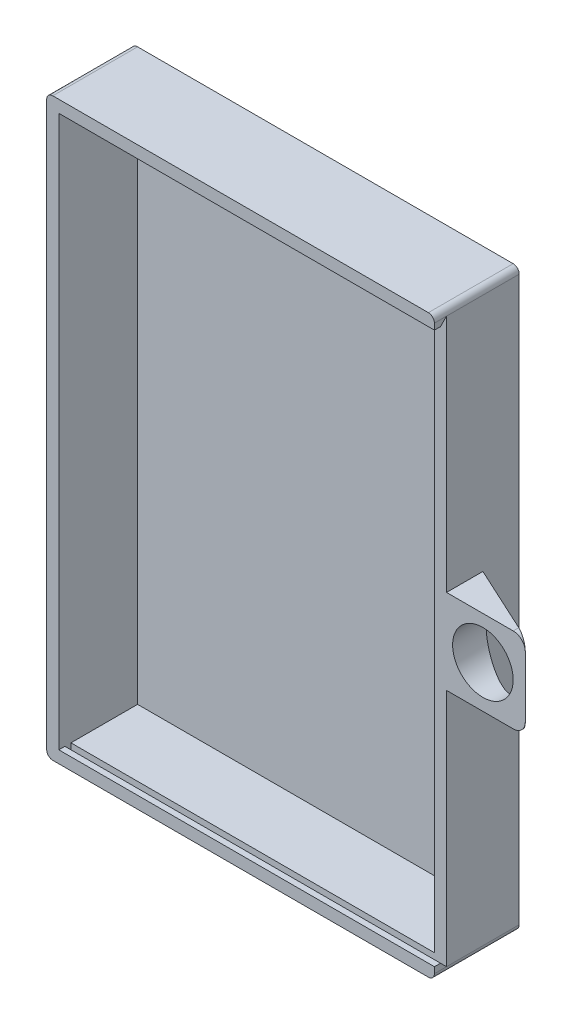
ISO-10303-21;
HEADER;
FILE_DESCRIPTION(('STEP AP214'),'2;1');
FILE_NAME('part.step','',(''),(''),'','','');
FILE_SCHEMA(('AUTOMOTIVE_DESIGN { 1 0 10303 214 1 1 1 1 }'));
ENDSEC;
DATA;
#1=APPLICATION_CONTEXT('core data for automotive mechanical design processes');
#2=APPLICATION_PROTOCOL_DEFINITION('international standard','automotive_design',2000,#1);
#3=PRODUCT_CONTEXT('',#1,'mechanical');
#4=PRODUCT('Part','Part','',(#3));
#5=PRODUCT_RELATED_PRODUCT_CATEGORY('part','',(#4));
#6=PRODUCT_DEFINITION_FORMATION('','',#4);
#7=PRODUCT_DEFINITION_CONTEXT('part definition',#1,'design');
#8=PRODUCT_DEFINITION('design','',#6,#7);
#9=PRODUCT_DEFINITION_SHAPE('','',#8);
#10=(LENGTH_UNIT() NAMED_UNIT(*) SI_UNIT(.MILLI.,.METRE.));
#11=(NAMED_UNIT(*) PLANE_ANGLE_UNIT() SI_UNIT($,.RADIAN.));
#12=(NAMED_UNIT(*) SI_UNIT($,.STERADIAN.) SOLID_ANGLE_UNIT());
#13=UNCERTAINTY_MEASURE_WITH_UNIT(LENGTH_MEASURE(1.E-05),#10,'distance_accuracy_value','');
#14=(GEOMETRIC_REPRESENTATION_CONTEXT(3) GLOBAL_UNCERTAINTY_ASSIGNED_CONTEXT((#13)) GLOBAL_UNIT_ASSIGNED_CONTEXT((#10,
#11,#12)) REPRESENTATION_CONTEXT('',''));
#15=CARTESIAN_POINT('',(0.,0.,0.));
#16=DIRECTION('',(0.,0.,1.));
#17=DIRECTION('',(1.,0.,0.));
#18=AXIS2_PLACEMENT_3D('',#15,#16,#17);
#19=CARTESIAN_POINT('',(32.,0.,-1.));
#20=DIRECTION('',(1.,0.,0.));
#21=DIRECTION('',(0.,0.,-1.));
#22=AXIS2_PLACEMENT_3D('',#19,#20,#21);
#23=PLANE('',#22);
#24=DIRECTION('',(0.,1.,0.));
#25=VECTOR('',#24,1.);
#26=CARTESIAN_POINT('',(32.,0.,-1.));
#27=LINE('',#26,#25);
#28=CARTESIAN_POINT('',(32.,-46.5,-1.));
#29=VERTEX_POINT('',#28);
#30=CARTESIAN_POINT('',(32.,46.5,-1.));
#31=VERTEX_POINT('',#30);
#32=EDGE_CURVE('E334',#29,#31,#27,.T.);
#33=ORIENTED_EDGE('',*,*,#32,.T.);
#34=DIRECTION('',(0.,0.,1.));
#35=VECTOR('',#34,1.);
#36=CARTESIAN_POINT('',(32.,46.5,13.));
#37=LINE('',#36,#35);
#38=CARTESIAN_POINT('',(32.,46.5,11.));
#39=VERTEX_POINT('',#38);
#40=EDGE_CURVE('E373',#31,#39,#37,.T.);
#41=ORIENTED_EDGE('',*,*,#40,.T.);
#42=DIRECTION('',(0.,1.,0.));
#43=VECTOR('',#42,1.);
#44=CARTESIAN_POINT('',(32.,-46.5,11.));
#45=LINE('',#44,#43);
#46=CARTESIAN_POINT('',(32.,6.99999999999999,11.));
#47=VERTEX_POINT('',#46);
#48=EDGE_CURVE('E261',#47,#39,#45,.T.);
#49=ORIENTED_EDGE('',*,*,#48,.F.);
#50=DIRECTION('',(0.,0.,-1.));
#51=VECTOR('',#50,1.);
#52=CARTESIAN_POINT('',(32.,7.,5.00000000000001));
#53=LINE('',#52,#51);
#54=CARTESIAN_POINT('',(32.,7.,5.00000000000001));
#55=VERTEX_POINT('',#54);
#56=EDGE_CURVE('E230',#47,#55,#53,.T.);
#57=ORIENTED_EDGE('',*,*,#56,.T.);
#58=DIRECTION('',(0.,1.,0.));
#59=VECTOR('',#58,1.);
#60=CARTESIAN_POINT('',(32.,-7.,5.00000000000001));
#61=LINE('',#60,#59);
#62=CARTESIAN_POINT('',(32.,-7.,5.00000000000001));
#63=VERTEX_POINT('',#62);
#64=EDGE_CURVE('E214',#63,#55,#61,.T.);
#65=ORIENTED_EDGE('',*,*,#64,.F.);
#66=DIRECTION('',(0.,0.,-1.));
#67=VECTOR('',#66,1.);
#68=CARTESIAN_POINT('',(32.,-7.,5.00000000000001));
#69=LINE('',#68,#67);
#70=CARTESIAN_POINT('',(32.,-7.00000000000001,11.));
#71=VERTEX_POINT('',#70);
#72=EDGE_CURVE('E231',#71,#63,#69,.T.);
#73=ORIENTED_EDGE('',*,*,#72,.F.);
#74=CARTESIAN_POINT('',(32.,-46.5,11.));
#75=VERTEX_POINT('',#74);
#76=EDGE_CURVE('E262',#75,#71,#45,.T.);
#77=ORIENTED_EDGE('',*,*,#76,.F.);
#78=DIRECTION('',(0.,0.,1.));
#79=VECTOR('',#78,1.);
#80=CARTESIAN_POINT('',(32.,-46.5,-1.));
#81=LINE('',#80,#79);
#82=EDGE_CURVE('E367',#75,#29,#81,.F.);
#83=ORIENTED_EDGE('',*,*,#82,.T.);
#84=EDGE_LOOP('',(#33,#41,#49,#57,#65,#73,#77,#83));
#85=FACE_BOUND('',#84,.T.);
#86=ADVANCED_FACE('F48',(#85),#23,.T.);
#87=DIRECTION('',(0.,1.,0.));
#88=VECTOR('',#87,1.);
#89=CARTESIAN_POINT('',(32.,-47.5,13.));
#90=LINE('',#89,#88);
#91=CARTESIAN_POINT('',(32.,-46.5,13.));
#92=VERTEX_POINT('',#91);
#93=CARTESIAN_POINT('',(32.,-45.5,13.));
#94=VERTEX_POINT('',#93);
#95=EDGE_CURVE('E321',#92,#94,#90,.T.);
#96=ORIENTED_EDGE('',*,*,#95,.F.);
#97=DIRECTION('',(0.,0.,1.));
#98=VECTOR('',#97,1.);
#99=CARTESIAN_POINT('',(32.,-46.5,-1.));
#100=LINE('',#99,#98);
#101=EDGE_CURVE('E369',#92,#75,#100,.F.);
#102=ORIENTED_EDGE('',*,*,#101,.T.);
#103=DIRECTION('',(0.,-0.707106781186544,-0.707106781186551));
#104=VECTOR('',#103,1.);
#105=CARTESIAN_POINT('',(32.,-46.5,11.));
#106=LINE('',#105,#104);
#107=CARTESIAN_POINT('',(32.,-45.5,12.));
#108=VERTEX_POINT('',#107);
#109=EDGE_CURVE('E258',#108,#75,#106,.T.);
#110=ORIENTED_EDGE('',*,*,#109,.F.);
#111=DIRECTION('',(0.,0.,-1.));
#112=VECTOR('',#111,1.);
#113=CARTESIAN_POINT('',(32.,-45.5,12.));
#114=LINE('',#113,#112);
#115=EDGE_CURVE('E246',#94,#108,#114,.T.);
#116=ORIENTED_EDGE('',*,*,#115,.F.);
#117=EDGE_LOOP('',(#96,#102,#110,#116));
#118=FACE_BOUND('',#117,.T.);
#119=ADVANCED_FACE('F429',(#118),#23,.T.);
#120=DIRECTION('',(0.,-0.707106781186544,0.707106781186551));
#121=VECTOR('',#120,1.);
#122=CARTESIAN_POINT('',(32.,46.5,11.));
#123=LINE('',#122,#121);
#124=CARTESIAN_POINT('',(32.,45.5,12.));
#125=VERTEX_POINT('',#124);
#126=EDGE_CURVE('E265',#39,#125,#123,.T.);
#127=ORIENTED_EDGE('',*,*,#126,.F.);
#128=DIRECTION('',(0.,0.,1.));
#129=VECTOR('',#128,1.);
#130=CARTESIAN_POINT('',(32.,46.5,13.));
#131=LINE('',#130,#129);
#132=CARTESIAN_POINT('',(32.,46.5,13.));
#133=VERTEX_POINT('',#132);
#134=EDGE_CURVE('E371',#39,#133,#131,.T.);
#135=ORIENTED_EDGE('',*,*,#134,.T.);
#136=CARTESIAN_POINT('',(32.,45.5,13.));
#137=VERTEX_POINT('',#136);
#138=EDGE_CURVE('E320',#137,#133,#90,.T.);
#139=ORIENTED_EDGE('',*,*,#138,.F.);
#140=DIRECTION('',(0.,0.,1.));
#141=VECTOR('',#140,1.);
#142=CARTESIAN_POINT('',(32.,45.5,13.));
#143=LINE('',#142,#141);
#144=EDGE_CURVE('E267',#125,#137,#143,.T.);
#145=ORIENTED_EDGE('',*,*,#144,.F.);
#146=EDGE_LOOP('',(#127,#135,#139,#145));
#147=FACE_BOUND('',#146,.T.);
#148=ADVANCED_FACE('F387',(#147),#23,.T.);
#149=CARTESIAN_POINT('',(30.,-45.5,13.));
#150=DIRECTION('',(0.,1.,0.));
#151=DIRECTION('',(0.,0.,1.));
#152=AXIS2_PLACEMENT_3D('',#149,#150,#151);
#153=PLANE('',#152);
#154=DIRECTION('',(-1.,0.,0.));
#155=VECTOR('',#154,1.);
#156=CARTESIAN_POINT('',(30.,-45.5,11.));
#157=LINE('',#156,#155);
#158=CARTESIAN_POINT('',(30.,-45.5,11.));
#159=VERTEX_POINT('',#158);
#160=CARTESIAN_POINT('',(-30.,-45.5,11.));
#161=VERTEX_POINT('',#160);
#162=EDGE_CURVE('E284',#159,#161,#157,.T.);
#163=ORIENTED_EDGE('',*,*,#162,.F.);
#164=DIRECTION('',(0.,0.,-1.));
#165=VECTOR('',#164,1.);
#166=CARTESIAN_POINT('',(30.,-45.5,13.));
#167=LINE('',#166,#165);
#168=CARTESIAN_POINT('',(30.,-45.5,0.));
#169=VERTEX_POINT('',#168);
#170=EDGE_CURVE('E311',#159,#169,#167,.T.);
#171=ORIENTED_EDGE('',*,*,#170,.T.);
#172=DIRECTION('',(1.,0.,0.));
#173=VECTOR('',#172,1.);
#174=CARTESIAN_POINT('',(30.,-45.5,0.));
#175=LINE('',#174,#173);
#176=CARTESIAN_POINT('',(-30.,-45.5,0.));
#177=VERTEX_POINT('',#176);
#178=EDGE_CURVE('E298',#177,#169,#175,.T.);
#179=ORIENTED_EDGE('',*,*,#178,.F.);
#180=DIRECTION('',(0.,0.,-1.));
#181=VECTOR('',#180,1.);
#182=CARTESIAN_POINT('',(-30.,-45.5,13.));
#183=LINE('',#182,#181);
#184=EDGE_CURVE('E313',#161,#177,#183,.T.);
#185=ORIENTED_EDGE('',*,*,#184,.F.);
#186=EDGE_LOOP('',(#163,#171,#179,#185));
#187=FACE_BOUND('',#186,.T.);
#188=ADVANCED_FACE('F414',(#187),#153,.T.);
#189=CARTESIAN_POINT('',(30.,45.5,13.));
#190=DIRECTION('',(0.,-1.,0.));
#191=DIRECTION('',(0.,0.,-1.));
#192=AXIS2_PLACEMENT_3D('',#189,#190,#191);
#193=PLANE('',#192);
#194=DIRECTION('',(1.,0.,0.));
#195=VECTOR('',#194,1.);
#196=CARTESIAN_POINT('',(-125.021502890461,45.5,12.));
#197=LINE('',#196,#195);
#198=CARTESIAN_POINT('',(-30.,45.5,12.));
#199=VERTEX_POINT('',#198);
#200=EDGE_CURVE('E271',#199,#125,#197,.T.);
#201=ORIENTED_EDGE('',*,*,#200,.T.);
#202=ORIENTED_EDGE('',*,*,#144,.T.);
#203=DIRECTION('',(-1.,0.,0.));
#204=VECTOR('',#203,1.);
#205=CARTESIAN_POINT('',(30.,45.5,13.));
#206=LINE('',#205,#204);
#207=CARTESIAN_POINT('',(-30.,45.5,13.));
#208=VERTEX_POINT('',#207);
#209=EDGE_CURVE('E293',#137,#208,#206,.T.);
#210=ORIENTED_EDGE('',*,*,#209,.T.);
#211=DIRECTION('',(0.,0.,-1.));
#212=VECTOR('',#211,1.);
#213=CARTESIAN_POINT('',(-30.,45.5,13.));
#214=LINE('',#213,#212);
#215=EDGE_CURVE('E306',#208,#199,#214,.T.);
#216=ORIENTED_EDGE('',*,*,#215,.T.);
#217=EDGE_LOOP('',(#201,#202,#210,#216));
#218=FACE_BOUND('',#217,.T.);
#219=ADVANCED_FACE('F391',(#218),#193,.T.);
#220=CARTESIAN_POINT('',(-32.,0.,-1.));
#221=DIRECTION('',(1.,0.,0.));
#222=DIRECTION('',(0.,0.,-1.));
#223=AXIS2_PLACEMENT_3D('',#220,#221,#222);
#224=PLANE('',#223);
#225=DIRECTION('',(0.,-1.,0.));
#226=VECTOR('',#225,1.);
#227=CARTESIAN_POINT('',(-32.,-47.5,13.));
#228=LINE('',#227,#226);
#229=CARTESIAN_POINT('',(-32.,46.5,13.));
#230=VERTEX_POINT('',#229);
#231=CARTESIAN_POINT('',(-32.,-46.5,13.));
#232=VERTEX_POINT('',#231);
#233=EDGE_CURVE('E326',#230,#232,#228,.T.);
#234=ORIENTED_EDGE('',*,*,#233,.F.);
#235=DIRECTION('',(0.,0.,1.));
#236=VECTOR('',#235,1.);
#237=CARTESIAN_POINT('',(-32.,46.5,-1.));
#238=LINE('',#237,#236);
#239=CARTESIAN_POINT('',(-32.,46.5,-1.));
#240=VERTEX_POINT('',#239);
#241=EDGE_CURVE('E358',#230,#240,#238,.F.);
#242=ORIENTED_EDGE('',*,*,#241,.T.);
#243=DIRECTION('',(0.,1.,0.));
#244=VECTOR('',#243,1.);
#245=CARTESIAN_POINT('',(-32.,0.,-1.));
#246=LINE('',#245,#244);
#247=CARTESIAN_POINT('',(-32.,-46.5,-1.));
#248=VERTEX_POINT('',#247);
#249=EDGE_CURVE('E329',#248,#240,#246,.T.);
#250=ORIENTED_EDGE('',*,*,#249,.F.);
#251=DIRECTION('',(0.,0.,1.));
#252=VECTOR('',#251,1.);
#253=CARTESIAN_POINT('',(-32.,-46.5,13.));
#254=LINE('',#253,#252);
#255=EDGE_CURVE('E355',#248,#232,#254,.T.);
#256=ORIENTED_EDGE('',*,*,#255,.T.);
#257=EDGE_LOOP('',(#234,#242,#250,#256));
#258=FACE_BOUND('',#257,.T.);
#259=ADVANCED_FACE('F447',(#258),#224,.F.);
#260=CARTESIAN_POINT('',(0.,47.5,-1.));
#261=DIRECTION('',(0.,-1.,0.));
#262=DIRECTION('',(0.,0.,-1.));
#263=AXIS2_PLACEMENT_3D('',#260,#261,#262);
#264=PLANE('',#263);
#265=DIRECTION('',(1.,0.,0.));
#266=VECTOR('',#265,1.);
#267=CARTESIAN_POINT('',(0.,47.5,-1.));
#268=LINE('',#267,#266);
#269=CARTESIAN_POINT('',(-31.,47.5,-1.));
#270=VERTEX_POINT('',#269);
#271=CARTESIAN_POINT('',(31.,47.5,-1.));
#272=VERTEX_POINT('',#271);
#273=EDGE_CURVE('E337',#270,#272,#268,.T.);
#274=ORIENTED_EDGE('',*,*,#273,.F.);
#275=DIRECTION('',(0.,0.,1.));
#276=VECTOR('',#275,1.);
#277=CARTESIAN_POINT('',(-31.,47.5,-1.));
#278=LINE('',#277,#276);
#279=CARTESIAN_POINT('',(-31.,47.5,13.));
#280=VERTEX_POINT('',#279);
#281=EDGE_CURVE('E344',#270,#280,#278,.T.);
#282=ORIENTED_EDGE('',*,*,#281,.T.);
#283=DIRECTION('',(-1.,0.,0.));
#284=VECTOR('',#283,1.);
#285=CARTESIAN_POINT('',(32.,47.5,13.));
#286=LINE('',#285,#284);
#287=CARTESIAN_POINT('',(31.,47.5,13.));
#288=VERTEX_POINT('',#287);
#289=EDGE_CURVE('E323',#288,#280,#286,.T.);
#290=ORIENTED_EDGE('',*,*,#289,.F.);
#291=DIRECTION('',(0.,0.,1.));
#292=VECTOR('',#291,1.);
#293=CARTESIAN_POINT('',(31.,47.5,-1.));
#294=LINE('',#293,#292);
#295=EDGE_CURVE('E342',#288,#272,#294,.F.);
#296=ORIENTED_EDGE('',*,*,#295,.T.);
#297=EDGE_LOOP('',(#274,#282,#290,#296));
#298=FACE_BOUND('',#297,.T.);
#299=ADVANCED_FACE('F457',(#298),#264,.F.);
#300=CARTESIAN_POINT('',(0.,-47.5,-1.));
#301=DIRECTION('',(0.,-1.,0.));
#302=DIRECTION('',(0.,0.,-1.));
#303=AXIS2_PLACEMENT_3D('',#300,#301,#302);
#304=PLANE('',#303);
#305=DIRECTION('',(1.,0.,0.));
#306=VECTOR('',#305,1.);
#307=CARTESIAN_POINT('',(0.,-47.5,-1.));
#308=LINE('',#307,#306);
#309=CARTESIAN_POINT('',(-31.,-47.5,-1.));
#310=VERTEX_POINT('',#309);
#311=CARTESIAN_POINT('',(31.,-47.5,-1.));
#312=VERTEX_POINT('',#311);
#313=EDGE_CURVE('E332',#310,#312,#308,.T.);
#314=ORIENTED_EDGE('',*,*,#313,.T.);
#315=DIRECTION('',(0.,0.,1.));
#316=VECTOR('',#315,1.);
#317=CARTESIAN_POINT('',(31.,-47.5,-1.));
#318=LINE('',#317,#316);
#319=CARTESIAN_POINT('',(31.,-47.5,13.));
#320=VERTEX_POINT('',#319);
#321=EDGE_CURVE('E12',#312,#320,#318,.T.);
#322=ORIENTED_EDGE('',*,*,#321,.T.);
#323=DIRECTION('',(1.,0.,0.));
#324=VECTOR('',#323,1.);
#325=CARTESIAN_POINT('',(32.,-47.5,13.));
#326=LINE('',#325,#324);
#327=CARTESIAN_POINT('',(-31.,-47.5,13.));
#328=VERTEX_POINT('',#327);
#329=EDGE_CURVE('E317',#328,#320,#326,.T.);
#330=ORIENTED_EDGE('',*,*,#329,.F.);
#331=DIRECTION('',(0.,0.,1.));
#332=VECTOR('',#331,1.);
#333=CARTESIAN_POINT('',(-31.,-47.5,-1.));
#334=LINE('',#333,#332);
#335=EDGE_CURVE('E56',#328,#310,#334,.F.);
#336=ORIENTED_EDGE('',*,*,#335,.T.);
#337=EDGE_LOOP('',(#314,#322,#330,#336));
#338=FACE_BOUND('',#337,.T.);
#339=ADVANCED_FACE('F438',(#338),#304,.T.);
#340=CARTESIAN_POINT('',(0.,0.,-1.));
#341=DIRECTION('',(0.,0.,1.));
#342=DIRECTION('',(1.,0.,0.));
#343=AXIS2_PLACEMENT_3D('',#340,#341,#342);
#344=PLANE('',#343);
#345=ORIENTED_EDGE('',*,*,#249,.T.);
#346=CARTESIAN_POINT('',(-31.,46.5,-1.));
#347=DIRECTION('',(0.,0.,1.));
#348=DIRECTION('',(1.,0.,0.));
#349=AXIS2_PLACEMENT_3D('',#346,#347,#348);
#350=CIRCLE('',#349,1.);
#351=EDGE_CURVE('E365',#240,#270,#350,.F.);
#352=ORIENTED_EDGE('',*,*,#351,.T.);
#353=ORIENTED_EDGE('',*,*,#273,.T.);
#354=CARTESIAN_POINT('',(31.,46.5,-1.));
#355=DIRECTION('',(0.,0.,1.));
#356=DIRECTION('',(1.,0.,0.));
#357=AXIS2_PLACEMENT_3D('',#354,#355,#356);
#358=CIRCLE('',#357,1.);
#359=EDGE_CURVE('E363',#272,#31,#358,.F.);
#360=ORIENTED_EDGE('',*,*,#359,.T.);
#361=ORIENTED_EDGE('',*,*,#32,.F.);
#362=CARTESIAN_POINT('',(31.,-46.5,-1.));
#363=DIRECTION('',(0.,0.,1.));
#364=DIRECTION('',(1.,0.,0.));
#365=AXIS2_PLACEMENT_3D('',#362,#363,#364);
#366=CIRCLE('',#365,1.);
#367=EDGE_CURVE('E63',#29,#312,#366,.F.);
#368=ORIENTED_EDGE('',*,*,#367,.T.);
#369=ORIENTED_EDGE('',*,*,#313,.F.);
#370=CARTESIAN_POINT('',(-31.,-46.5,-1.));
#371=DIRECTION('',(0.,0.,1.));
#372=DIRECTION('',(1.,0.,0.));
#373=AXIS2_PLACEMENT_3D('',#370,#371,#372);
#374=CIRCLE('',#373,1.);
#375=EDGE_CURVE('E360',#310,#248,#374,.F.);
#376=ORIENTED_EDGE('',*,*,#375,.T.);
#377=EDGE_LOOP('',(#345,#352,#353,#360,#361,#368,#369,#376));
#378=FACE_BOUND('',#377,.T.);
#379=ADVANCED_FACE('F450',(#378),#344,.F.);
#380=CARTESIAN_POINT('',(0.,0.,13.));
#381=DIRECTION('',(0.,0.,-1.));
#382=DIRECTION('',(-1.,0.,0.));
#383=AXIS2_PLACEMENT_3D('',#380,#381,#382);
#384=PLANE('',#383);
#385=ORIENTED_EDGE('',*,*,#289,.T.);
#386=CARTESIAN_POINT('',(-31.,46.5,13.));
#387=DIRECTION('',(0.,0.,-1.));
#388=DIRECTION('',(-1.,0.,0.));
#389=AXIS2_PLACEMENT_3D('',#386,#387,#388);
#390=CIRCLE('',#389,1.);
#391=EDGE_CURVE('E353',#280,#230,#390,.F.);
#392=ORIENTED_EDGE('',*,*,#391,.T.);
#393=ORIENTED_EDGE('',*,*,#233,.T.);
#394=CARTESIAN_POINT('',(-31.,-46.5,13.));
#395=DIRECTION('',(0.,0.,-1.));
#396=DIRECTION('',(-1.,0.,0.));
#397=AXIS2_PLACEMENT_3D('',#394,#395,#396);
#398=CIRCLE('',#397,1.);
#399=EDGE_CURVE('E347',#232,#328,#398,.F.);
#400=ORIENTED_EDGE('',*,*,#399,.T.);
#401=ORIENTED_EDGE('',*,*,#329,.T.);
#402=CARTESIAN_POINT('',(31.,-46.5,13.));
#403=DIRECTION('',(0.,0.,-1.));
#404=DIRECTION('',(-1.,0.,0.));
#405=AXIS2_PLACEMENT_3D('',#402,#403,#404);
#406=CIRCLE('',#405,1.);
#407=EDGE_CURVE('E349',#320,#92,#406,.F.);
#408=ORIENTED_EDGE('',*,*,#407,.T.);
#409=ORIENTED_EDGE('',*,*,#95,.T.);
#410=DIRECTION('',(1.,0.,0.));
#411=VECTOR('',#410,1.);
#412=CARTESIAN_POINT('',(30.,-45.5,13.));
#413=LINE('',#412,#411);
#414=CARTESIAN_POINT('',(-30.,-45.5,13.));
#415=VERTEX_POINT('',#414);
#416=EDGE_CURVE('E289',#415,#94,#413,.T.);
#417=ORIENTED_EDGE('',*,*,#416,.F.);
#418=DIRECTION('',(0.,-1.,0.));
#419=VECTOR('',#418,1.);
#420=CARTESIAN_POINT('',(-30.,-45.5,13.));
#421=LINE('',#420,#419);
#422=EDGE_CURVE('E287',#208,#415,#421,.T.);
#423=ORIENTED_EDGE('',*,*,#422,.F.);
#424=ORIENTED_EDGE('',*,*,#209,.F.);
#425=ORIENTED_EDGE('',*,*,#138,.T.);
#426=CARTESIAN_POINT('',(31.,46.5,13.));
#427=DIRECTION('',(0.,0.,-1.));
#428=DIRECTION('',(-1.,0.,0.));
#429=AXIS2_PLACEMENT_3D('',#426,#427,#428);
#430=CIRCLE('',#429,1.);
#431=EDGE_CURVE('E351',#133,#288,#430,.F.);
#432=ORIENTED_EDGE('',*,*,#431,.T.);
#433=EDGE_LOOP('',(#385,#392,#393,#400,#401,#408,#409,#417,#423,#424,#425,#432));
#434=FACE_BOUND('',#433,.T.);
#435=ADVANCED_FACE('F440',(#434),#384,.F.);
#436=CARTESIAN_POINT('',(-30.,-45.5,13.));
#437=DIRECTION('',(1.,0.,0.));
#438=DIRECTION('',(0.,0.,-1.));
#439=AXIS2_PLACEMENT_3D('',#436,#437,#438);
#440=PLANE('',#439);
#441=CARTESIAN_POINT('',(-30.,45.5,11.));
#442=VERTEX_POINT('',#441);
#443=CARTESIAN_POINT('',(-30.,45.5,0.));
#444=VERTEX_POINT('',#443);
#445=EDGE_CURVE('E295',#442,#444,#214,.T.);
#446=ORIENTED_EDGE('',*,*,#445,.F.);
#447=DIRECTION('',(0.,-1.,0.));
#448=VECTOR('',#447,1.);
#449=CARTESIAN_POINT('',(-30.,-46.5,11.));
#450=LINE('',#449,#448);
#451=CARTESIAN_POINT('',(-30.,46.5,11.));
#452=VERTEX_POINT('',#451);
#453=EDGE_CURVE('E250',#452,#442,#450,.T.);
#454=ORIENTED_EDGE('',*,*,#453,.F.);
#455=DIRECTION('',(0.,0.707106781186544,-0.707106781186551));
#456=VECTOR('',#455,1.);
#457=CARTESIAN_POINT('',(-30.,46.5,11.));
#458=LINE('',#457,#456);
#459=EDGE_CURVE('E252',#199,#452,#458,.T.);
#460=ORIENTED_EDGE('',*,*,#459,.F.);
#461=ORIENTED_EDGE('',*,*,#215,.F.);
#462=ORIENTED_EDGE('',*,*,#422,.T.);
#463=CARTESIAN_POINT('',(-30.,-45.5,12.));
#464=VERTEX_POINT('',#463);
#465=EDGE_CURVE('E314',#415,#464,#183,.T.);
#466=ORIENTED_EDGE('',*,*,#465,.T.);
#467=DIRECTION('',(0.,0.707106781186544,0.707106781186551));
#468=VECTOR('',#467,1.);
#469=CARTESIAN_POINT('',(-30.,-46.5,11.));
#470=LINE('',#469,#468);
#471=CARTESIAN_POINT('',(-30.,-46.5,11.));
#472=VERTEX_POINT('',#471);
#473=EDGE_CURVE('E255',#472,#464,#470,.T.);
#474=ORIENTED_EDGE('',*,*,#473,.F.);
#475=EDGE_CURVE('E253',#161,#472,#450,.T.);
#476=ORIENTED_EDGE('',*,*,#475,.F.);
#477=ORIENTED_EDGE('',*,*,#184,.T.);
#478=DIRECTION('',(0.,-1.,0.));
#479=VECTOR('',#478,1.);
#480=CARTESIAN_POINT('',(-30.,-45.5,0.));
#481=LINE('',#480,#479);
#482=EDGE_CURVE('E286',#444,#177,#481,.T.);
#483=ORIENTED_EDGE('',*,*,#482,.F.);
#484=EDGE_LOOP('',(#446,#454,#460,#461,#462,#466,#474,#476,#477,#483));
#485=FACE_BOUND('',#484,.T.);
#486=ADVANCED_FACE('F395',(#485),#440,.T.);
#487=DIRECTION('',(1.,0.,0.));
#488=VECTOR('',#487,1.);
#489=CARTESIAN_POINT('',(-125.021502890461,-45.5,12.));
#490=LINE('',#489,#488);
#491=EDGE_CURVE('E270',#464,#108,#490,.T.);
#492=ORIENTED_EDGE('',*,*,#491,.F.);
#493=ORIENTED_EDGE('',*,*,#465,.F.);
#494=ORIENTED_EDGE('',*,*,#416,.T.);
#495=ORIENTED_EDGE('',*,*,#115,.T.);
#496=EDGE_LOOP('',(#492,#493,#494,#495));
#497=FACE_BOUND('',#496,.T.);
#498=ADVANCED_FACE('F423',(#497),#153,.T.);
#499=CARTESIAN_POINT('',(30.,-45.5,13.));
#500=DIRECTION('',(-1.,0.,0.));
#501=DIRECTION('',(0.,0.,1.));
#502=AXIS2_PLACEMENT_3D('',#499,#500,#501);
#503=PLANE('',#502);
#504=DIRECTION('',(0.,-1.,0.));
#505=VECTOR('',#504,1.);
#506=CARTESIAN_POINT('',(30.,-45.5,11.));
#507=LINE('',#506,#505);
#508=CARTESIAN_POINT('',(30.,45.5,11.));
#509=VERTEX_POINT('',#508);
#510=EDGE_CURVE('E282',#509,#159,#507,.T.);
#511=ORIENTED_EDGE('',*,*,#510,.F.);
#512=DIRECTION('',(0.,0.,-1.));
#513=VECTOR('',#512,1.);
#514=CARTESIAN_POINT('',(30.,45.5,13.));
#515=LINE('',#514,#513);
#516=CARTESIAN_POINT('',(30.,45.5,0.));
#517=VERTEX_POINT('',#516);
#518=EDGE_CURVE('E309',#509,#517,#515,.T.);
#519=ORIENTED_EDGE('',*,*,#518,.T.);
#520=DIRECTION('',(0.,1.,0.));
#521=VECTOR('',#520,1.);
#522=CARTESIAN_POINT('',(30.,-45.5,0.));
#523=LINE('',#522,#521);
#524=EDGE_CURVE('E301',#169,#517,#523,.T.);
#525=ORIENTED_EDGE('',*,*,#524,.F.);
#526=ORIENTED_EDGE('',*,*,#170,.F.);
#527=EDGE_LOOP('',(#511,#519,#525,#526));
#528=FACE_BOUND('',#527,.T.);
#529=ADVANCED_FACE('F406',(#528),#503,.T.);
#530=DIRECTION('',(1.,0.,0.));
#531=VECTOR('',#530,1.);
#532=CARTESIAN_POINT('',(30.,45.5,11.));
#533=LINE('',#532,#531);
#534=EDGE_CURVE('E340',#442,#509,#533,.T.);
#535=ORIENTED_EDGE('',*,*,#534,.F.);
#536=ORIENTED_EDGE('',*,*,#445,.T.);
#537=DIRECTION('',(-1.,0.,0.));
#538=VECTOR('',#537,1.);
#539=CARTESIAN_POINT('',(30.,45.5,0.));
#540=LINE('',#539,#538);
#541=EDGE_CURVE('E290',#517,#444,#540,.T.);
#542=ORIENTED_EDGE('',*,*,#541,.F.);
#543=ORIENTED_EDGE('',*,*,#518,.F.);
#544=EDGE_LOOP('',(#535,#536,#542,#543));
#545=FACE_BOUND('',#544,.T.);
#546=ADVANCED_FACE('F402',(#545),#193,.T.);
#547=CARTESIAN_POINT('',(0.,0.,0.));
#548=DIRECTION('',(0.,0.,1.));
#549=DIRECTION('',(1.,0.,0.));
#550=AXIS2_PLACEMENT_3D('',#547,#548,#549);
#551=PLANE('',#550);
#552=ORIENTED_EDGE('',*,*,#482,.T.);
#553=ORIENTED_EDGE('',*,*,#178,.T.);
#554=ORIENTED_EDGE('',*,*,#524,.T.);
#555=ORIENTED_EDGE('',*,*,#541,.T.);
#556=EDGE_LOOP('',(#552,#553,#554,#555));
#557=FACE_BOUND('',#556,.T.);
#558=ADVANCED_FACE('F409',(#557),#551,.T.);
#559=CARTESIAN_POINT('',(-125.021502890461,46.5,11.));
#560=DIRECTION('',(0.,0.707106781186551,0.707106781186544));
#561=DIRECTION('',(0.,-0.707106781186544,0.707106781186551));
#562=AXIS2_PLACEMENT_3D('',#559,#560,#561);
#563=PLANE('',#562);
#564=ORIENTED_EDGE('',*,*,#459,.T.);
#565=DIRECTION('',(1.,0.,0.));
#566=VECTOR('',#565,1.);
#567=CARTESIAN_POINT('',(-125.021502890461,46.5,11.));
#568=LINE('',#567,#566);
#569=EDGE_CURVE('E274',#452,#39,#568,.T.);
#570=ORIENTED_EDGE('',*,*,#569,.T.);
#571=ORIENTED_EDGE('',*,*,#126,.T.);
#572=ORIENTED_EDGE('',*,*,#200,.F.);
#573=EDGE_LOOP('',(#564,#570,#571,#572));
#574=FACE_BOUND('',#573,.T.);
#575=ADVANCED_FACE('F382',(#574),#563,.F.);
#576=CARTESIAN_POINT('',(-125.021502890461,-46.5,11.));
#577=DIRECTION('',(0.,0.,-1.));
#578=DIRECTION('',(0.,1.,0.));
#579=AXIS2_PLACEMENT_3D('',#576,#577,#578);
#580=PLANE('',#579);
#581=ORIENTED_EDGE('',*,*,#162,.T.);
#582=ORIENTED_EDGE('',*,*,#475,.T.);
#583=DIRECTION('',(1.,0.,0.));
#584=VECTOR('',#583,1.);
#585=CARTESIAN_POINT('',(-125.021502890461,-46.5,11.));
#586=LINE('',#585,#584);
#587=EDGE_CURVE('E277',#472,#75,#586,.T.);
#588=ORIENTED_EDGE('',*,*,#587,.T.);
#589=ORIENTED_EDGE('',*,*,#76,.T.);
#590=DIRECTION('',(-1.,0.,0.));
#591=VECTOR('',#590,1.);
#592=CARTESIAN_POINT('',(32.,-7.,11.));
#593=LINE('',#592,#591);
#594=CARTESIAN_POINT('',(43.,-7.,11.));
#595=VERTEX_POINT('',#594);
#596=EDGE_CURVE('E241',#595,#71,#593,.T.);
#597=ORIENTED_EDGE('',*,*,#596,.F.);
#598=CARTESIAN_POINT('',(43.,-5.,11.));
#599=DIRECTION('',(0.,0.,-1.));
#600=DIRECTION('',(-1.,0.,0.));
#601=AXIS2_PLACEMENT_3D('',#598,#599,#600);
#602=CIRCLE('',#601,2.);
#603=CARTESIAN_POINT('',(45.,-4.99999999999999,11.));
#604=VERTEX_POINT('',#603);
#605=EDGE_CURVE('E737',#595,#604,#602,.F.);
#606=ORIENTED_EDGE('',*,*,#605,.T.);
#607=DIRECTION('',(0.,1.,0.));
#608=VECTOR('',#607,1.);
#609=CARTESIAN_POINT('',(45.,-7.,11.));
#610=LINE('',#609,#608);
#611=CARTESIAN_POINT('',(45.,4.99999999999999,11.));
#612=VERTEX_POINT('',#611);
#613=EDGE_CURVE('E226',#604,#612,#610,.T.);
#614=ORIENTED_EDGE('',*,*,#613,.T.);
#615=CARTESIAN_POINT('',(43.,5.,11.));
#616=DIRECTION('',(0.,0.,-1.));
#617=DIRECTION('',(-1.,0.,0.));
#618=AXIS2_PLACEMENT_3D('',#615,#616,#617);
#619=CIRCLE('',#618,2.);
#620=CARTESIAN_POINT('',(43.,7.,11.));
#621=VERTEX_POINT('',#620);
#622=EDGE_CURVE('E206',#612,#621,#619,.F.);
#623=ORIENTED_EDGE('',*,*,#622,.T.);
#624=DIRECTION('',(-1.,0.,0.));
#625=VECTOR('',#624,1.);
#626=CARTESIAN_POINT('',(32.,7.,11.));
#627=LINE('',#626,#625);
#628=EDGE_CURVE('E222',#621,#47,#627,.T.);
#629=ORIENTED_EDGE('',*,*,#628,.T.);
#630=ORIENTED_EDGE('',*,*,#48,.T.);
#631=ORIENTED_EDGE('',*,*,#569,.F.);
#632=ORIENTED_EDGE('',*,*,#453,.T.);
#633=ORIENTED_EDGE('',*,*,#534,.T.);
#634=ORIENTED_EDGE('',*,*,#510,.T.);
#635=EDGE_LOOP('',(#581,#582,#588,#589,#597,#606,#614,#623,#629,#630,#631,#632,#633,#634));
#636=FACE_BOUND('',#635,.T.);
#637=CARTESIAN_POINT('',(38.,0.,11.));
#638=DIRECTION('',(0.,0.,-1.));
#639=DIRECTION('',(-1.,0.,0.));
#640=AXIS2_PLACEMENT_3D('',#637,#638,#639);
#641=CIRCLE('',#640,5.);
#642=CARTESIAN_POINT('',(33.,0.,11.));
#643=VERTEX_POINT('',#642);
#644=EDGE_CURVE('E247',#643,#643,#641,.T.);
#645=ORIENTED_EDGE('',*,*,#644,.T.);
#646=EDGE_LOOP('',(#645));
#647=FACE_BOUND('',#646,.T.);
#648=ADVANCED_FACE('F219',(#636,#647),#580,.F.);
#649=CARTESIAN_POINT('',(-125.021502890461,-46.5,11.));
#650=DIRECTION('',(0.,-0.707106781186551,0.707106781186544));
#651=DIRECTION('',(0.,-0.707106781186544,-0.707106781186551));
#652=AXIS2_PLACEMENT_3D('',#649,#650,#651);
#653=PLANE('',#652);
#654=ORIENTED_EDGE('',*,*,#473,.T.);
#655=ORIENTED_EDGE('',*,*,#491,.T.);
#656=ORIENTED_EDGE('',*,*,#109,.T.);
#657=ORIENTED_EDGE('',*,*,#587,.F.);
#658=EDGE_LOOP('',(#654,#655,#656,#657));
#659=FACE_BOUND('',#658,.T.);
#660=ADVANCED_FACE('F421',(#659),#653,.F.);
#661=CARTESIAN_POINT('',(45.,-7.,11.));
#662=DIRECTION('',(-0.419058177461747,0.,0.907959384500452));
#663=DIRECTION('',(0.907959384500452,0.,0.419058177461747));
#664=AXIS2_PLACEMENT_3D('',#661,#662,#663);
#665=PLANE('',#664);
#666=CARTESIAN_POINT('',(38.,0.,7.76923076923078));
#667=DIRECTION('',(-0.419058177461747,0.,0.907959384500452));
#668=DIRECTION('',(0.907959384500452,0.,0.419058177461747));
#669=AXIS2_PLACEMENT_3D('',#666,#667,#668);
#670=ELLIPSE('',#669,5.50685425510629,5.);
#671=CARTESIAN_POINT('',(43.,0.,10.0769230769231));
#672=VERTEX_POINT('',#671);
#673=EDGE_CURVE('E227',#672,#672,#670,.T.);
#674=ORIENTED_EDGE('',*,*,#673,.T.);
#675=EDGE_LOOP('',(#674));
#676=FACE_BOUND('',#675,.T.);
#677=DIRECTION('',(0.907959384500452,0.,0.419058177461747));
#678=VECTOR('',#677,1.);
#679=CARTESIAN_POINT('',(45.,7.,11.));
#680=LINE('',#679,#678);
#681=CARTESIAN_POINT('',(43.,7.,10.0769230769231));
#682=VERTEX_POINT('',#681);
#683=EDGE_CURVE('E232',#55,#682,#680,.T.);
#684=ORIENTED_EDGE('',*,*,#683,.T.);
#685=CARTESIAN_POINT('',(43.,5.,10.0769230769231));
#686=DIRECTION('',(-0.419058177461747,0.,0.907959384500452));
#687=DIRECTION('',(-0.907959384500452,0.,-0.419058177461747));
#688=AXIS2_PLACEMENT_3D('',#685,#686,#687);
#689=ELLIPSE('',#688,2.20274170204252,2.);
#690=EDGE_CURVE('E208',#682,#612,#689,.F.);
#691=ORIENTED_EDGE('',*,*,#690,.T.);
#692=ORIENTED_EDGE('',*,*,#613,.F.);
#693=CARTESIAN_POINT('',(43.,-5.,10.0769230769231));
#694=DIRECTION('',(-0.419058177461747,0.,0.907959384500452));
#695=DIRECTION('',(-0.907959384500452,0.,-0.419058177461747));
#696=AXIS2_PLACEMENT_3D('',#693,#694,#695);
#697=ELLIPSE('',#696,2.20274170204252,2.);
#698=CARTESIAN_POINT('',(43.,-7.,10.0769230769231));
#699=VERTEX_POINT('',#698);
#700=EDGE_CURVE('E739',#604,#699,#697,.F.);
#701=ORIENTED_EDGE('',*,*,#700,.T.);
#702=DIRECTION('',(0.907959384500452,0.,0.419058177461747));
#703=VECTOR('',#702,1.);
#704=CARTESIAN_POINT('',(45.,-7.,11.));
#705=LINE('',#704,#703);
#706=EDGE_CURVE('E235',#63,#699,#705,.T.);
#707=ORIENTED_EDGE('',*,*,#706,.F.);
#708=ORIENTED_EDGE('',*,*,#64,.T.);
#709=EDGE_LOOP('',(#684,#691,#692,#701,#707,#708));
#710=FACE_BOUND('',#709,.T.);
#711=ADVANCED_FACE('F552',(#676,#710),#665,.F.);
#712=CARTESIAN_POINT('',(0.,-7.,0.));
#713=DIRECTION('',(0.,1.,0.));
#714=DIRECTION('',(0.,0.,1.));
#715=AXIS2_PLACEMENT_3D('',#712,#713,#714);
#716=PLANE('',#715);
#717=ORIENTED_EDGE('',*,*,#706,.T.);
#718=DIRECTION('',(0.,0.,-1.));
#719=VECTOR('',#718,1.);
#720=CARTESIAN_POINT('',(43.,-7.,13.));
#721=LINE('',#720,#719);
#722=EDGE_CURVE('E213',#699,#595,#721,.F.);
#723=ORIENTED_EDGE('',*,*,#722,.T.);
#724=ORIENTED_EDGE('',*,*,#596,.T.);
#725=ORIENTED_EDGE('',*,*,#72,.T.);
#726=EDGE_LOOP('',(#717,#723,#724,#725));
#727=FACE_BOUND('',#726,.T.);
#728=ADVANCED_FACE('F568',(#727),#716,.F.);
#729=CARTESIAN_POINT('',(0.,7.,0.));
#730=DIRECTION('',(0.,1.,0.));
#731=DIRECTION('',(0.,0.,1.));
#732=AXIS2_PLACEMENT_3D('',#729,#730,#731);
#733=PLANE('',#732);
#734=DIRECTION('',(0.,0.,-1.));
#735=VECTOR('',#734,1.);
#736=CARTESIAN_POINT('',(43.,7.,13.));
#737=LINE('',#736,#735);
#738=EDGE_CURVE('E203',#682,#621,#737,.F.);
#739=ORIENTED_EDGE('',*,*,#738,.F.);
#740=ORIENTED_EDGE('',*,*,#683,.F.);
#741=ORIENTED_EDGE('',*,*,#56,.F.);
#742=ORIENTED_EDGE('',*,*,#628,.F.);
#743=EDGE_LOOP('',(#739,#740,#741,#742));
#744=FACE_BOUND('',#743,.T.);
#745=ADVANCED_FACE('F229',(#744),#733,.T.);
#746=CARTESIAN_POINT('',(43.,5.,13.));
#747=DIRECTION('',(0.,0.,-1.));
#748=DIRECTION('',(-1.,0.,0.));
#749=AXIS2_PLACEMENT_3D('',#746,#747,#748);
#750=CYLINDRICAL_SURFACE('',#749,2.);
#751=ORIENTED_EDGE('',*,*,#738,.T.);
#752=ORIENTED_EDGE('',*,*,#622,.F.);
#753=ORIENTED_EDGE('',*,*,#690,.F.);
#754=EDGE_LOOP('',(#751,#752,#753));
#755=FACE_BOUND('',#754,.T.);
#756=ADVANCED_FACE('F205',(#755),#750,.T.);
#757=CARTESIAN_POINT('',(43.,-5.,13.));
#758=DIRECTION('',(0.,0.,-1.));
#759=DIRECTION('',(-1.,0.,0.));
#760=AXIS2_PLACEMENT_3D('',#757,#758,#759);
#761=CYLINDRICAL_SURFACE('',#760,2.);
#762=ORIENTED_EDGE('',*,*,#605,.F.);
#763=ORIENTED_EDGE('',*,*,#722,.F.);
#764=ORIENTED_EDGE('',*,*,#700,.F.);
#765=EDGE_LOOP('',(#762,#763,#764));
#766=FACE_BOUND('',#765,.T.);
#767=ADVANCED_FACE('F598',(#766),#761,.T.);
#768=CARTESIAN_POINT('',(38.,0.,-1.));
#769=DIRECTION('',(0.,0.,1.));
#770=DIRECTION('',(1.,0.,0.));
#771=AXIS2_PLACEMENT_3D('',#768,#769,#770);
#772=CYLINDRICAL_SURFACE('',#771,5.);
#773=ORIENTED_EDGE('',*,*,#644,.F.);
#774=EDGE_LOOP('',(#773));
#775=FACE_BOUND('',#774,.T.);
#776=ORIENTED_EDGE('',*,*,#673,.F.);
#777=EDGE_LOOP('',(#776));
#778=FACE_BOUND('',#777,.T.);
#779=ADVANCED_FACE('F467',(#775,#778),#772,.F.);
#780=CARTESIAN_POINT('',(-31.,46.5,-1.));
#781=DIRECTION('',(0.,0.,1.));
#782=DIRECTION('',(1.,0.,0.));
#783=AXIS2_PLACEMENT_3D('',#780,#781,#782);
#784=CYLINDRICAL_SURFACE('',#783,1.);
#785=ORIENTED_EDGE('',*,*,#351,.F.);
#786=ORIENTED_EDGE('',*,*,#241,.F.);
#787=ORIENTED_EDGE('',*,*,#391,.F.);
#788=ORIENTED_EDGE('',*,*,#281,.F.);
#789=EDGE_LOOP('',(#785,#786,#787,#788));
#790=FACE_BOUND('',#789,.T.);
#791=ADVANCED_FACE('F454',(#790),#784,.T.);
#792=CARTESIAN_POINT('',(31.,46.5,-1.));
#793=DIRECTION('',(0.,0.,-1.));
#794=DIRECTION('',(-1.,0.,0.));
#795=AXIS2_PLACEMENT_3D('',#792,#793,#794);
#796=CYLINDRICAL_SURFACE('',#795,1.);
#797=ORIENTED_EDGE('',*,*,#359,.F.);
#798=ORIENTED_EDGE('',*,*,#295,.F.);
#799=ORIENTED_EDGE('',*,*,#431,.F.);
#800=ORIENTED_EDGE('',*,*,#134,.F.);
#801=ORIENTED_EDGE('',*,*,#40,.F.);
#802=EDGE_LOOP('',(#797,#798,#799,#800,#801));
#803=FACE_BOUND('',#802,.T.);
#804=ADVANCED_FACE('F460',(#803),#796,.T.);
#805=CARTESIAN_POINT('',(31.,-46.5,-1.));
#806=DIRECTION('',(0.,0.,1.));
#807=DIRECTION('',(1.,0.,0.));
#808=AXIS2_PLACEMENT_3D('',#805,#806,#807);
#809=CYLINDRICAL_SURFACE('',#808,1.);
#810=ORIENTED_EDGE('',*,*,#82,.F.);
#811=ORIENTED_EDGE('',*,*,#101,.F.);
#812=ORIENTED_EDGE('',*,*,#407,.F.);
#813=ORIENTED_EDGE('',*,*,#321,.F.);
#814=ORIENTED_EDGE('',*,*,#367,.F.);
#815=EDGE_LOOP('',(#810,#811,#812,#813,#814));
#816=FACE_BOUND('',#815,.T.);
#817=ADVANCED_FACE('F436',(#816),#809,.T.);
#818=CARTESIAN_POINT('',(-31.,-46.5,-1.));
#819=DIRECTION('',(0.,0.,-1.));
#820=DIRECTION('',(-1.,0.,0.));
#821=AXIS2_PLACEMENT_3D('',#818,#819,#820);
#822=CYLINDRICAL_SURFACE('',#821,1.);
#823=ORIENTED_EDGE('',*,*,#375,.F.);
#824=ORIENTED_EDGE('',*,*,#335,.F.);
#825=ORIENTED_EDGE('',*,*,#399,.F.);
#826=ORIENTED_EDGE('',*,*,#255,.F.);
#827=EDGE_LOOP('',(#823,#824,#825,#826));
#828=FACE_BOUND('',#827,.T.);
#829=ADVANCED_FACE('F50',(#828),#822,.T.);
#830=CLOSED_SHELL('',(#86,#119,#148,#188,#219,#259,#299,#339,#379,#435,#486,#498,#529,#546,#558,
#575,#648,#660,#711,#728,#745,#756,#767,#779,#791,#804,#817,#829));
#831=MANIFOLD_SOLID_BREP('B2',#830);
#832=ADVANCED_BREP_SHAPE_REPRESENTATION('',(#18,#831),#14);
#833=SHAPE_DEFINITION_REPRESENTATION(#9,#832);
ENDSEC;
END-ISO-10303-21;
